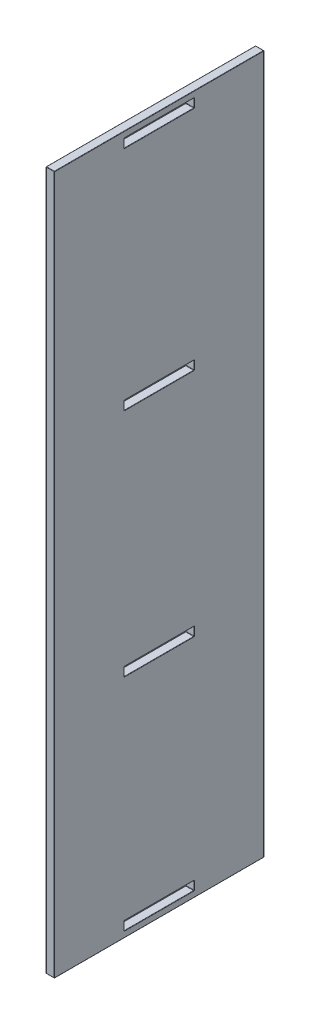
from build123d import *

# Parameters (mm, degrees)
SKETCH1_W           = 300
SKETCH1_H           = 1000
SKETCH1_W_2         = 100
SKETCH1_H_2         = 12.5
BOSS_EXTRUDE1_DEPTH = 12
FILLET1_R           = 0.5


with BuildPart() as part:
    # Sketch1 → Boss-Extrude1 (new body)
    with BuildSketch(Plane(origin=(0, 0, 0), x_dir=(0, 0, -1), z_dir=(1, 0, 0))):
        Rectangle(SKETCH1_W, SKETCH1_H)
        with Locations((0, 485)):
            Rectangle(SKETCH1_W_2, SKETCH1_H_2, mode=Mode.SUBTRACT)
        with Locations((0, -485)):
            Rectangle(SKETCH1_W_2, SKETCH1_H_2, mode=Mode.SUBTRACT)
        with Locations((0, 160)):
            Rectangle(SKETCH1_W_2, SKETCH1_H_2, mode=Mode.SUBTRACT)
        with Locations((0, -170)):
            Rectangle(SKETCH1_W_2, SKETCH1_H_2, mode=Mode.SUBTRACT)
    extrude(amount=BOSS_EXTRUDE1_DEPTH)

    # Fillet1
    fillet1_edges = [part.edges().sort_by_distance(p)[0] for p in [
        (12, 0, 150),
        (12, -500, 0),
        (0, 485, -50),
        (6, 478.75, -50),
        (0, 491.25, 0),
        (6, 491.25, -50),
        (0, 485, 50),
        (6, 491.25, 50),
        (0, 478.75, 0),
        (6, 478.75, 50),
        (12, 485, -50),
        (12, 491.25, 0),
        (12, 485, 50),
        (12, 478.75, 0),
        (0, -485, 50),
        (6, -478.75, 50),
        (0, -491.25, 0),
        (6, -491.25, 50),
        (0, -485, -50),
        (6, -491.25, -50),
        (0, -478.75, 0),
        (6, -478.75, -50),
        (12, -485, 50),
        (12, -491.25, 0),
        (12, -485, -50),
        (12, -478.75, 0),
        (12, 0, -150),
        (0, 160, -50),
        (6, 153.75, -50),
        (0, 166.25, 0),
        (6, 166.25, -50),
        (0, 160, 50),
        (6, 166.25, 50),
        (0, 153.75, 0),
        (6, 153.75, 50),
        (12, 160, -50),
        (12, 166.25, 0),
        (12, 160, 50),
        (12, 153.75, 0),
        (0, -500, 0),
        (0, 0, 150),
        (0, 500, 0),
        (0, -170, -50),
        (6, -176.25, -50),
        (0, -163.75, 0),
        (6, -163.75, -50),
        (0, -170, 50),
        (6, -163.75, 50),
        (0, -176.25, 0),
        (6, -176.25, 50),
        (12, -170, -50),
        (12, -163.75, 0),
        (12, -170, 50),
        (12, -176.25, 0),
        (0, 0, -150),
        (12, 500, 0),
        (6, -500, -150),
        (6, -500, 150),
        (6, 500, 150),
        (6, 500, -150),
    ]]
    fillet(fillet1_edges, radius=FILLET1_R)


solid = part.part
